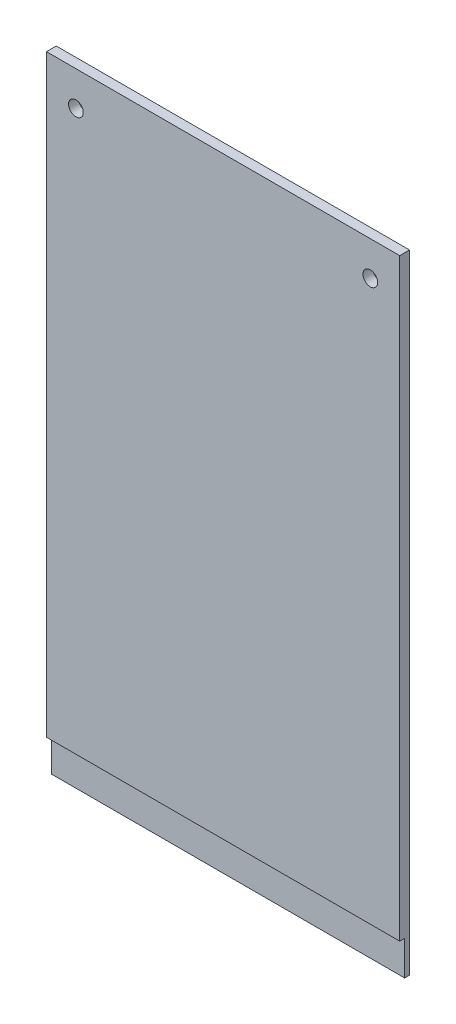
from build123d import *

# Parameters (mm, degrees)
SKETCH2_W           = 72
SKETCH2_H           = 249
BOSS_EXTRUDE1_DEPTH = 2
SKETCH3_R           = 1.5
CUT_EXTRUDE1_DEPTH  = 130.615778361
SKETCH5_W           = 72
SKETCH5_H           = 120
CUT_EXTRUDE2_DEPTH  = 130.615778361
SKETCH4_W           = 1
SKETCH4_H           = 5.5
CUT_EXTRUDE3_DEPTH  = 144.83410583
SKETCH6_W           = 1
SKETCH6_H           = 1.5
CUT_EXTRUDE4_DEPTH  = 144.83410583
SKETCH8_W           = 2
SKETCH8_H           = 1
CUT_EXTRUDE5_DEPTH  = 144.83410583


with BuildPart() as part:
    # Sketch2 → Boss-Extrude1 (new body)
    with BuildSketch(Plane.XY):
        Rectangle(SKETCH2_W, SKETCH2_H)
    extrude(amount=BOSS_EXTRUDE1_DEPTH)

    # Sketch3 → Cut-Extrude1 (cut, through all)
    with BuildSketch(Plane.XY.offset(2)):
        with Locations((30, 116.5)):
            Circle(SKETCH3_R)
        with Locations((-30, 116.5)):
            Circle(SKETCH3_R)
        with Locations((30, -116.5)):
            Circle(SKETCH3_R)
        with Locations((-30, -116.5)):
            Circle(SKETCH3_R)
    extrude(amount=-CUT_EXTRUDE1_DEPTH, mode=Mode.SUBTRACT)

    # Sketch5 → Cut-Extrude2 (cut, through all)
    with BuildSketch(Plane.XY.offset(2)):
        with Locations((0, -64.5)):
            Rectangle(SKETCH5_W, SKETCH5_H)
    extrude(amount=-CUT_EXTRUDE2_DEPTH, mode=Mode.SUBTRACT)

    # Sketch4 → Cut-Extrude3 (cut, through all)
    with BuildSketch(Plane(origin=(36, 0, 0), x_dir=(0, 0, -1), z_dir=(1, 0, 0))):
        with Locations((-1.5, -0.25)):
            Rectangle(SKETCH4_W, SKETCH4_H)
    extrude(amount=-CUT_EXTRUDE3_DEPTH, mode=Mode.SUBTRACT)

    # Sketch6 → Cut-Extrude4 (cut, through all)
    with BuildSketch(Plane(origin=(36, 0, 0), x_dir=(0, 0, -1), z_dir=(1, 0, 0))):
        with Locations((-1.5, -3.75)):
            Rectangle(SKETCH6_W, SKETCH6_H)
    extrude(amount=-CUT_EXTRUDE4_DEPTH, mode=Mode.SUBTRACT)

    # Sketch8 → Cut-Extrude5 (cut, through all)
    with BuildSketch(Plane(origin=(36, 0, 0), x_dir=(0, 0, -1), z_dir=(1, 0, 0))):
        with Locations((-1, 124)):
            Rectangle(SKETCH8_W, SKETCH8_H)
    extrude(amount=-CUT_EXTRUDE5_DEPTH, mode=Mode.SUBTRACT)


solid = part.part
